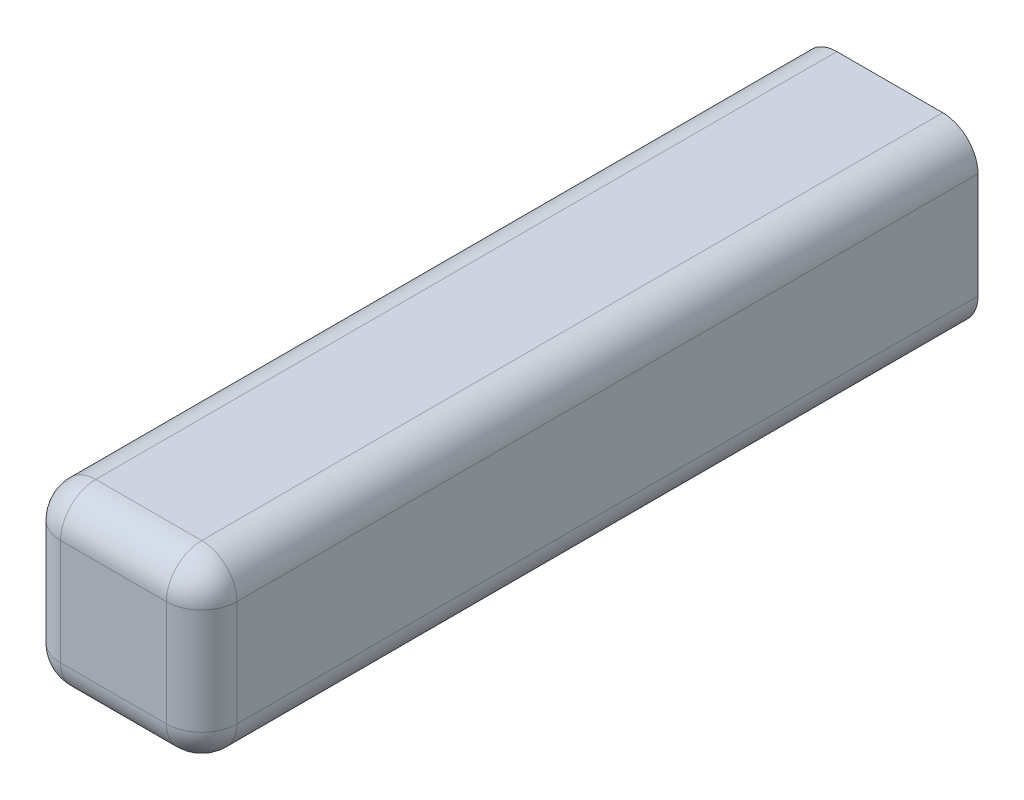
ISO-10303-21;
HEADER;
FILE_DESCRIPTION(('STEP AP214'),'2;1');
FILE_NAME('part.step','',(''),(''),'','','');
FILE_SCHEMA(('AUTOMOTIVE_DESIGN { 1 0 10303 214 1 1 1 1 }'));
ENDSEC;
DATA;
#1=APPLICATION_CONTEXT('core data for automotive mechanical design processes');
#2=APPLICATION_PROTOCOL_DEFINITION('international standard','automotive_design',2000,#1);
#3=PRODUCT_CONTEXT('',#1,'mechanical');
#4=PRODUCT('Part','Part','',(#3));
#5=PRODUCT_RELATED_PRODUCT_CATEGORY('part','',(#4));
#6=PRODUCT_DEFINITION_FORMATION('','',#4);
#7=PRODUCT_DEFINITION_CONTEXT('part definition',#1,'design');
#8=PRODUCT_DEFINITION('design','',#6,#7);
#9=PRODUCT_DEFINITION_SHAPE('','',#8);
#10=(LENGTH_UNIT() NAMED_UNIT(*) SI_UNIT(.MILLI.,.METRE.));
#11=(NAMED_UNIT(*) PLANE_ANGLE_UNIT() SI_UNIT($,.RADIAN.));
#12=(NAMED_UNIT(*) SI_UNIT($,.STERADIAN.) SOLID_ANGLE_UNIT());
#13=UNCERTAINTY_MEASURE_WITH_UNIT(LENGTH_MEASURE(1.E-05),#10,'distance_accuracy_value','');
#14=(GEOMETRIC_REPRESENTATION_CONTEXT(3) GLOBAL_UNCERTAINTY_ASSIGNED_CONTEXT((#13)) GLOBAL_UNIT_ASSIGNED_CONTEXT((#10,
#11,#12)) REPRESENTATION_CONTEXT('',''));
#15=CARTESIAN_POINT('',(0.,0.,0.));
#16=DIRECTION('',(0.,0.,1.));
#17=DIRECTION('',(1.,0.,0.));
#18=AXIS2_PLACEMENT_3D('',#15,#16,#17);
#19=CARTESIAN_POINT('',(0.,0.,22.));
#20=DIRECTION('',(1.,0.,0.));
#21=DIRECTION('',(0.,0.,-1.));
#22=AXIS2_PLACEMENT_3D('',#19,#20,#21);
#23=PLANE('',#22);
#24=DIRECTION('',(0.,-1.,0.));
#25=VECTOR('',#24,1.);
#26=CARTESIAN_POINT('',(0.,0.,21.));
#27=LINE('',#26,#25);
#28=CARTESIAN_POINT('',(0.,1.,21.));
#29=VERTEX_POINT('',#28);
#30=CARTESIAN_POINT('',(0.,4.,21.));
#31=VERTEX_POINT('',#30);
#32=EDGE_CURVE('E55',#29,#31,#27,.F.);
#33=ORIENTED_EDGE('',*,*,#32,.T.);
#34=DIRECTION('',(0.,0.,-1.));
#35=VECTOR('',#34,1.);
#36=CARTESIAN_POINT('',(0.,4.,22.));
#37=LINE('',#36,#35);
#38=CARTESIAN_POINT('',(0.,4.,0.));
#39=VERTEX_POINT('',#38);
#40=EDGE_CURVE('E11',#31,#39,#37,.T.);
#41=ORIENTED_EDGE('',*,*,#40,.T.);
#42=DIRECTION('',(0.,-1.,0.));
#43=VECTOR('',#42,1.);
#44=CARTESIAN_POINT('',(0.,0.,0.));
#45=LINE('',#44,#43);
#46=CARTESIAN_POINT('',(0.,1.,0.));
#47=VERTEX_POINT('',#46);
#48=EDGE_CURVE('E201',#39,#47,#45,.T.);
#49=ORIENTED_EDGE('',*,*,#48,.T.);
#50=DIRECTION('',(0.,0.,-1.));
#51=VECTOR('',#50,1.);
#52=CARTESIAN_POINT('',(0.,1.,22.));
#53=LINE('',#52,#51);
#54=EDGE_CURVE('E66',#47,#29,#53,.F.);
#55=ORIENTED_EDGE('',*,*,#54,.T.);
#56=EDGE_LOOP('',(#33,#41,#49,#55));
#57=FACE_BOUND('',#56,.T.);
#58=ADVANCED_FACE('F45',(#57),#23,.F.);
#59=CARTESIAN_POINT('',(0.,0.,22.));
#60=DIRECTION('',(0.,1.,0.));
#61=DIRECTION('',(0.,0.,1.));
#62=AXIS2_PLACEMENT_3D('',#59,#60,#61);
#63=PLANE('',#62);
#64=DIRECTION('',(1.,0.,0.));
#65=VECTOR('',#64,1.);
#66=CARTESIAN_POINT('',(0.,0.,0.));
#67=LINE('',#66,#65);
#68=CARTESIAN_POINT('',(1.,0.,0.));
#69=VERTEX_POINT('',#68);
#70=CARTESIAN_POINT('',(4.,0.,0.));
#71=VERTEX_POINT('',#70);
#72=EDGE_CURVE('E210',#69,#71,#67,.T.);
#73=ORIENTED_EDGE('',*,*,#72,.T.);
#74=DIRECTION('',(0.,0.,-1.));
#75=VECTOR('',#74,1.);
#76=CARTESIAN_POINT('',(4.,0.,22.));
#77=LINE('',#76,#75);
#78=CARTESIAN_POINT('',(4.,0.,21.));
#79=VERTEX_POINT('',#78);
#80=EDGE_CURVE('E278',#71,#79,#77,.F.);
#81=ORIENTED_EDGE('',*,*,#80,.T.);
#82=DIRECTION('',(1.,0.,0.));
#83=VECTOR('',#82,1.);
#84=CARTESIAN_POINT('',(0.,0.,21.));
#85=LINE('',#84,#83);
#86=CARTESIAN_POINT('',(1.,0.,21.));
#87=VERTEX_POINT('',#86);
#88=EDGE_CURVE('E274',#79,#87,#85,.F.);
#89=ORIENTED_EDGE('',*,*,#88,.T.);
#90=DIRECTION('',(0.,0.,-1.));
#91=VECTOR('',#90,1.);
#92=CARTESIAN_POINT('',(1.,0.,22.));
#93=LINE('',#92,#91);
#94=EDGE_CURVE('E271',#87,#69,#93,.T.);
#95=ORIENTED_EDGE('',*,*,#94,.T.);
#96=EDGE_LOOP('',(#73,#81,#89,#95));
#97=FACE_BOUND('',#96,.T.);
#98=ADVANCED_FACE('F408',(#97),#63,.F.);
#99=CARTESIAN_POINT('',(5.,0.,22.));
#100=DIRECTION('',(-1.,0.,0.));
#101=DIRECTION('',(0.,0.,1.));
#102=AXIS2_PLACEMENT_3D('',#99,#100,#101);
#103=PLANE('',#102);
#104=DIRECTION('',(0.,1.,0.));
#105=VECTOR('',#104,1.);
#106=CARTESIAN_POINT('',(5.,0.,21.));
#107=LINE('',#106,#105);
#108=CARTESIAN_POINT('',(5.,4.,21.));
#109=VERTEX_POINT('',#108);
#110=CARTESIAN_POINT('',(5.,1.,21.));
#111=VERTEX_POINT('',#110);
#112=EDGE_CURVE('E284',#109,#111,#107,.F.);
#113=ORIENTED_EDGE('',*,*,#112,.T.);
#114=DIRECTION('',(0.,0.,-1.));
#115=VECTOR('',#114,1.);
#116=CARTESIAN_POINT('',(5.,1.,22.));
#117=LINE('',#116,#115);
#118=CARTESIAN_POINT('',(5.,1.,0.));
#119=VERTEX_POINT('',#118);
#120=EDGE_CURVE('E287',#111,#119,#117,.T.);
#121=ORIENTED_EDGE('',*,*,#120,.T.);
#122=DIRECTION('',(0.,1.,0.));
#123=VECTOR('',#122,1.);
#124=CARTESIAN_POINT('',(5.,0.,0.));
#125=LINE('',#124,#123);
#126=CARTESIAN_POINT('',(5.,4.,0.));
#127=VERTEX_POINT('',#126);
#128=EDGE_CURVE('E214',#119,#127,#125,.T.);
#129=ORIENTED_EDGE('',*,*,#128,.T.);
#130=DIRECTION('',(0.,0.,-1.));
#131=VECTOR('',#130,1.);
#132=CARTESIAN_POINT('',(5.,4.,22.));
#133=LINE('',#132,#131);
#134=EDGE_CURVE('E281',#127,#109,#133,.F.);
#135=ORIENTED_EDGE('',*,*,#134,.T.);
#136=EDGE_LOOP('',(#113,#121,#129,#135));
#137=FACE_BOUND('',#136,.T.);
#138=ADVANCED_FACE('F391',(#137),#103,.F.);
#139=CARTESIAN_POINT('',(0.,5.,22.));
#140=DIRECTION('',(0.,-1.,0.));
#141=DIRECTION('',(0.,0.,-1.));
#142=AXIS2_PLACEMENT_3D('',#139,#140,#141);
#143=PLANE('',#142);
#144=DIRECTION('',(-1.,0.,0.));
#145=VECTOR('',#144,1.);
#146=CARTESIAN_POINT('',(0.,5.,21.));
#147=LINE('',#146,#145);
#148=CARTESIAN_POINT('',(1.,5.,21.));
#149=VERTEX_POINT('',#148);
#150=CARTESIAN_POINT('',(4.,5.,21.));
#151=VERTEX_POINT('',#150);
#152=EDGE_CURVE('E293',#149,#151,#147,.F.);
#153=ORIENTED_EDGE('',*,*,#152,.T.);
#154=DIRECTION('',(0.,0.,-1.));
#155=VECTOR('',#154,1.);
#156=CARTESIAN_POINT('',(4.,5.,22.));
#157=LINE('',#156,#155);
#158=CARTESIAN_POINT('',(4.,5.,0.));
#159=VERTEX_POINT('',#158);
#160=EDGE_CURVE('E296',#151,#159,#157,.T.);
#161=ORIENTED_EDGE('',*,*,#160,.T.);
#162=DIRECTION('',(-1.,0.,0.));
#163=VECTOR('',#162,1.);
#164=CARTESIAN_POINT('',(0.,5.,0.));
#165=LINE('',#164,#163);
#166=CARTESIAN_POINT('',(1.,5.,0.));
#167=VERTEX_POINT('',#166);
#168=EDGE_CURVE('E218',#159,#167,#165,.T.);
#169=ORIENTED_EDGE('',*,*,#168,.T.);
#170=DIRECTION('',(0.,0.,-1.));
#171=VECTOR('',#170,1.);
#172=CARTESIAN_POINT('',(1.,5.,22.));
#173=LINE('',#172,#171);
#174=EDGE_CURVE('E290',#167,#149,#173,.F.);
#175=ORIENTED_EDGE('',*,*,#174,.T.);
#176=EDGE_LOOP('',(#153,#161,#169,#175));
#177=FACE_BOUND('',#176,.T.);
#178=ADVANCED_FACE('F378',(#177),#143,.F.);
#179=CARTESIAN_POINT('',(0.,0.,22.));
#180=DIRECTION('',(0.,0.,-1.));
#181=DIRECTION('',(-1.,0.,0.));
#182=AXIS2_PLACEMENT_3D('',#179,#180,#181);
#183=PLANE('',#182);
#184=DIRECTION('',(0.,-1.,0.));
#185=VECTOR('',#184,1.);
#186=CARTESIAN_POINT('',(1.,0.,22.));
#187=LINE('',#186,#185);
#188=CARTESIAN_POINT('',(1.,4.,22.));
#189=VERTEX_POINT('',#188);
#190=CARTESIAN_POINT('',(1.,1.,22.));
#191=VERTEX_POINT('',#190);
#192=EDGE_CURVE('E258',#189,#191,#187,.T.);
#193=ORIENTED_EDGE('',*,*,#192,.T.);
#194=DIRECTION('',(1.,0.,0.));
#195=VECTOR('',#194,1.);
#196=CARTESIAN_POINT('',(0.,1.,22.));
#197=LINE('',#196,#195);
#198=CARTESIAN_POINT('',(4.,1.,22.));
#199=VERTEX_POINT('',#198);
#200=EDGE_CURVE('E267',#191,#199,#197,.T.);
#201=ORIENTED_EDGE('',*,*,#200,.T.);
#202=DIRECTION('',(0.,1.,0.));
#203=VECTOR('',#202,1.);
#204=CARTESIAN_POINT('',(4.,0.,22.));
#205=LINE('',#204,#203);
#206=CARTESIAN_POINT('',(4.,4.,22.));
#207=VERTEX_POINT('',#206);
#208=EDGE_CURVE('E264',#199,#207,#205,.T.);
#209=ORIENTED_EDGE('',*,*,#208,.T.);
#210=DIRECTION('',(-1.,0.,0.));
#211=VECTOR('',#210,1.);
#212=CARTESIAN_POINT('',(0.,4.,22.));
#213=LINE('',#212,#211);
#214=EDGE_CURVE('E261',#207,#189,#213,.T.);
#215=ORIENTED_EDGE('',*,*,#214,.T.);
#216=EDGE_LOOP('',(#193,#201,#209,#215));
#217=FACE_BOUND('',#216,.T.);
#218=ADVANCED_FACE('F368',(#217),#183,.F.);
#219=CARTESIAN_POINT('',(0.,0.,0.));
#220=DIRECTION('',(0.,0.,-1.));
#221=DIRECTION('',(-1.,0.,0.));
#222=AXIS2_PLACEMENT_3D('',#219,#220,#221);
#223=PLANE('',#222);
#224=DIRECTION('',(0.,1.,0.));
#225=VECTOR('',#224,1.);
#226=CARTESIAN_POINT('',(0.5,1.5,0.));
#227=LINE('',#226,#225);
#228=CARTESIAN_POINT('',(0.5,4.5,0.));
#229=VERTEX_POINT('',#228);
#230=CARTESIAN_POINT('',(0.5,0.500000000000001,0.));
#231=VERTEX_POINT('',#230);
#232=EDGE_CURVE('E243',#229,#231,#227,.F.);
#233=ORIENTED_EDGE('',*,*,#232,.T.);
#234=DIRECTION('',(-1.,0.,0.));
#235=VECTOR('',#234,1.);
#236=CARTESIAN_POINT('',(3.5,0.500000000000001,0.));
#237=LINE('',#236,#235);
#238=CARTESIAN_POINT('',(4.5,0.500000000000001,0.));
#239=VERTEX_POINT('',#238);
#240=EDGE_CURVE('E246',#231,#239,#237,.F.);
#241=ORIENTED_EDGE('',*,*,#240,.T.);
#242=DIRECTION('',(0.,-1.,0.));
#243=VECTOR('',#242,1.);
#244=CARTESIAN_POINT('',(4.5,3.5,0.));
#245=LINE('',#244,#243);
#246=CARTESIAN_POINT('',(4.5,4.5,0.));
#247=VERTEX_POINT('',#246);
#248=EDGE_CURVE('E237',#239,#247,#245,.F.);
#249=ORIENTED_EDGE('',*,*,#248,.T.);
#250=DIRECTION('',(1.,0.,0.));
#251=VECTOR('',#250,1.);
#252=CARTESIAN_POINT('',(1.5,4.5,0.));
#253=LINE('',#252,#251);
#254=EDGE_CURVE('E240',#247,#229,#253,.F.);
#255=ORIENTED_EDGE('',*,*,#254,.T.);
#256=EDGE_LOOP('',(#233,#241,#249,#255));
#257=FACE_BOUND('',#256,.T.);
#258=ORIENTED_EDGE('',*,*,#128,.F.);
#259=CARTESIAN_POINT('',(4.,1.,0.));
#260=DIRECTION('',(0.,0.,-1.));
#261=DIRECTION('',(-1.,0.,0.));
#262=AXIS2_PLACEMENT_3D('',#259,#260,#261);
#263=CIRCLE('',#262,1.);
#264=EDGE_CURVE('E234',#119,#71,#263,.T.);
#265=ORIENTED_EDGE('',*,*,#264,.T.);
#266=ORIENTED_EDGE('',*,*,#72,.F.);
#267=CARTESIAN_POINT('',(1.,1.,0.));
#268=DIRECTION('',(0.,0.,-1.));
#269=DIRECTION('',(-1.,0.,0.));
#270=AXIS2_PLACEMENT_3D('',#267,#268,#269);
#271=CIRCLE('',#270,1.);
#272=EDGE_CURVE('E225',#69,#47,#271,.T.);
#273=ORIENTED_EDGE('',*,*,#272,.T.);
#274=ORIENTED_EDGE('',*,*,#48,.F.);
#275=CARTESIAN_POINT('',(1.,4.,0.));
#276=DIRECTION('',(0.,0.,-1.));
#277=DIRECTION('',(-1.,0.,0.));
#278=AXIS2_PLACEMENT_3D('',#275,#276,#277);
#279=CIRCLE('',#278,1.);
#280=EDGE_CURVE('E228',#39,#167,#279,.T.);
#281=ORIENTED_EDGE('',*,*,#280,.T.);
#282=ORIENTED_EDGE('',*,*,#168,.F.);
#283=CARTESIAN_POINT('',(4.,4.,0.));
#284=DIRECTION('',(0.,0.,-1.));
#285=DIRECTION('',(-1.,0.,0.));
#286=AXIS2_PLACEMENT_3D('',#283,#284,#285);
#287=CIRCLE('',#286,1.);
#288=EDGE_CURVE('E231',#159,#127,#287,.T.);
#289=ORIENTED_EDGE('',*,*,#288,.T.);
#290=EDGE_LOOP('',(#258,#265,#266,#273,#274,#281,#282,#289));
#291=FACE_BOUND('',#290,.T.);
#292=ADVANCED_FACE('F388',(#257,#291),#223,.T.);
#293=CARTESIAN_POINT('',(3.5,3.5,19.));
#294=DIRECTION('',(1.,0.,0.));
#295=DIRECTION('',(0.,0.,-1.));
#296=AXIS2_PLACEMENT_3D('',#293,#294,#295);
#297=PLANE('',#296);
#298=DIRECTION('',(0.,0.,-1.));
#299=VECTOR('',#298,1.);
#300=CARTESIAN_POINT('',(3.5,3.5,19.));
#301=LINE('',#300,#299);
#302=CARTESIAN_POINT('',(3.5,3.5,19.));
#303=VERTEX_POINT('',#302);
#304=CARTESIAN_POINT('',(3.5,3.5,1.));
#305=VERTEX_POINT('',#304);
#306=EDGE_CURVE('E198',#303,#305,#301,.T.);
#307=ORIENTED_EDGE('',*,*,#306,.T.);
#308=DIRECTION('',(0.,-1.,0.));
#309=VECTOR('',#308,1.);
#310=CARTESIAN_POINT('',(3.5,1.5,1.));
#311=LINE('',#310,#309);
#312=CARTESIAN_POINT('',(3.5,1.5,1.));
#313=VERTEX_POINT('',#312);
#314=EDGE_CURVE('E166',#305,#313,#311,.T.);
#315=ORIENTED_EDGE('',*,*,#314,.T.);
#316=DIRECTION('',(0.,0.,-1.));
#317=VECTOR('',#316,1.);
#318=CARTESIAN_POINT('',(3.5,1.5,19.));
#319=LINE('',#318,#317);
#320=CARTESIAN_POINT('',(3.5,1.5,19.));
#321=VERTEX_POINT('',#320);
#322=EDGE_CURVE('E158',#321,#313,#319,.T.);
#323=ORIENTED_EDGE('',*,*,#322,.F.);
#324=DIRECTION('',(0.,-1.,0.));
#325=VECTOR('',#324,1.);
#326=CARTESIAN_POINT('',(3.5,3.5,19.));
#327=LINE('',#326,#325);
#328=EDGE_CURVE('E163',#303,#321,#327,.T.);
#329=ORIENTED_EDGE('',*,*,#328,.F.);
#330=EDGE_LOOP('',(#307,#315,#323,#329));
#331=FACE_BOUND('',#330,.T.);
#332=ADVANCED_FACE('F161',(#331),#297,.F.);
#333=CARTESIAN_POINT('',(3.5,3.5,19.));
#334=DIRECTION('',(0.,1.,0.));
#335=DIRECTION('',(0.,0.,1.));
#336=AXIS2_PLACEMENT_3D('',#333,#334,#335);
#337=PLANE('',#336);
#338=DIRECTION('',(0.,0.,-1.));
#339=VECTOR('',#338,1.);
#340=CARTESIAN_POINT('',(1.5,3.5,19.));
#341=LINE('',#340,#339);
#342=CARTESIAN_POINT('',(1.5,3.5,19.));
#343=VERTEX_POINT('',#342);
#344=CARTESIAN_POINT('',(1.5,3.5,1.));
#345=VERTEX_POINT('',#344);
#346=EDGE_CURVE('E202',#343,#345,#341,.T.);
#347=ORIENTED_EDGE('',*,*,#346,.T.);
#348=DIRECTION('',(1.,0.,0.));
#349=VECTOR('',#348,1.);
#350=CARTESIAN_POINT('',(3.5,3.5,1.));
#351=LINE('',#350,#349);
#352=EDGE_CURVE('E253',#345,#305,#351,.T.);
#353=ORIENTED_EDGE('',*,*,#352,.T.);
#354=ORIENTED_EDGE('',*,*,#306,.F.);
#355=DIRECTION('',(1.,0.,0.));
#356=VECTOR('',#355,1.);
#357=CARTESIAN_POINT('',(3.5,3.5,19.));
#358=LINE('',#357,#356);
#359=EDGE_CURVE('E172',#343,#303,#358,.T.);
#360=ORIENTED_EDGE('',*,*,#359,.F.);
#361=EDGE_LOOP('',(#347,#353,#354,#360));
#362=FACE_BOUND('',#361,.T.);
#363=ADVANCED_FACE('F582',(#362),#337,.F.);
#364=CARTESIAN_POINT('',(1.5,3.5,19.));
#365=DIRECTION('',(-1.,0.,0.));
#366=DIRECTION('',(0.,-1.,0.));
#367=AXIS2_PLACEMENT_3D('',#364,#365,#366);
#368=PLANE('',#367);
#369=DIRECTION('',(0.,0.,-1.));
#370=VECTOR('',#369,1.);
#371=CARTESIAN_POINT('',(1.5,1.5,19.));
#372=LINE('',#371,#370);
#373=CARTESIAN_POINT('',(1.5,1.5,19.));
#374=VERTEX_POINT('',#373);
#375=CARTESIAN_POINT('',(1.5,1.5,1.));
#376=VERTEX_POINT('',#375);
#377=EDGE_CURVE('E171',#374,#376,#372,.T.);
#378=ORIENTED_EDGE('',*,*,#377,.T.);
#379=DIRECTION('',(0.,1.,0.));
#380=VECTOR('',#379,1.);
#381=CARTESIAN_POINT('',(1.5,3.5,1.));
#382=LINE('',#381,#380);
#383=EDGE_CURVE('E250',#376,#345,#382,.T.);
#384=ORIENTED_EDGE('',*,*,#383,.T.);
#385=ORIENTED_EDGE('',*,*,#346,.F.);
#386=DIRECTION('',(0.,1.,0.));
#387=VECTOR('',#386,1.);
#388=CARTESIAN_POINT('',(1.5,3.5,19.));
#389=LINE('',#388,#387);
#390=EDGE_CURVE('E182',#374,#343,#389,.T.);
#391=ORIENTED_EDGE('',*,*,#390,.F.);
#392=EDGE_LOOP('',(#378,#384,#385,#391));
#393=FACE_BOUND('',#392,.T.);
#394=ADVANCED_FACE('F573',(#393),#368,.F.);
#395=CARTESIAN_POINT('',(3.5,1.5,19.));
#396=DIRECTION('',(0.,-1.,0.));
#397=DIRECTION('',(0.,0.,-1.));
#398=AXIS2_PLACEMENT_3D('',#395,#396,#397);
#399=PLANE('',#398);
#400=ORIENTED_EDGE('',*,*,#322,.T.);
#401=DIRECTION('',(-1.,0.,0.));
#402=VECTOR('',#401,1.);
#403=CARTESIAN_POINT('',(1.5,1.5,1.));
#404=LINE('',#403,#402);
#405=EDGE_CURVE('E222',#313,#376,#404,.T.);
#406=ORIENTED_EDGE('',*,*,#405,.T.);
#407=ORIENTED_EDGE('',*,*,#377,.F.);
#408=DIRECTION('',(-1.,0.,0.));
#409=VECTOR('',#408,1.);
#410=CARTESIAN_POINT('',(3.5,1.5,19.));
#411=LINE('',#410,#409);
#412=EDGE_CURVE('E175',#321,#374,#411,.T.);
#413=ORIENTED_EDGE('',*,*,#412,.F.);
#414=EDGE_LOOP('',(#400,#406,#407,#413));
#415=FACE_BOUND('',#414,.T.);
#416=ADVANCED_FACE('F176',(#415),#399,.F.);
#417=CARTESIAN_POINT('',(0.,0.,19.));
#418=DIRECTION('',(0.,0.,-1.));
#419=DIRECTION('',(-1.,0.,0.));
#420=AXIS2_PLACEMENT_3D('',#417,#418,#419);
#421=PLANE('',#420);
#422=ORIENTED_EDGE('',*,*,#328,.T.);
#423=ORIENTED_EDGE('',*,*,#412,.T.);
#424=ORIENTED_EDGE('',*,*,#390,.T.);
#425=ORIENTED_EDGE('',*,*,#359,.T.);
#426=EDGE_LOOP('',(#422,#423,#424,#425));
#427=FACE_BOUND('',#426,.T.);
#428=ADVANCED_FACE('F184',(#427),#421,.T.);
#429=CARTESIAN_POINT('',(3.5,4.5,1.));
#430=DIRECTION('',(-1.,0.,0.));
#431=DIRECTION('',(0.,0.,1.));
#432=AXIS2_PLACEMENT_3D('',#429,#430,#431);
#433=CYLINDRICAL_SURFACE('',#432,1.);
#434=CARTESIAN_POINT('',(0.5,4.5,1.));
#435=DIRECTION('',(-0.707106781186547,-0.707106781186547,0.));
#436=DIRECTION('',(0.707106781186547,-0.707106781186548,0.));
#437=AXIS2_PLACEMENT_3D('',#434,#435,#436);
#438=ELLIPSE('',#437,1.41421356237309,1.);
#439=EDGE_CURVE('E191',#229,#345,#438,.T.);
#440=ORIENTED_EDGE('',*,*,#439,.F.);
#441=ORIENTED_EDGE('',*,*,#254,.F.);
#442=CARTESIAN_POINT('',(4.5,4.5,1.));
#443=DIRECTION('',(-0.707106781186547,0.707106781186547,0.));
#444=DIRECTION('',(-0.707106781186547,-0.707106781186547,0.));
#445=AXIS2_PLACEMENT_3D('',#442,#443,#444);
#446=ELLIPSE('',#445,1.41421356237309,1.);
#447=EDGE_CURVE('E187',#305,#247,#446,.F.);
#448=ORIENTED_EDGE('',*,*,#447,.F.);
#449=ORIENTED_EDGE('',*,*,#352,.F.);
#450=EDGE_LOOP('',(#440,#441,#448,#449));
#451=FACE_BOUND('',#450,.T.);
#452=ADVANCED_FACE('F445',(#451),#433,.T.);
#453=CARTESIAN_POINT('',(4.5,3.5,1.));
#454=DIRECTION('',(0.,1.,0.));
#455=DIRECTION('',(0.,0.,1.));
#456=AXIS2_PLACEMENT_3D('',#453,#454,#455);
#457=CYLINDRICAL_SURFACE('',#456,1.);
#458=ORIENTED_EDGE('',*,*,#447,.T.);
#459=ORIENTED_EDGE('',*,*,#248,.F.);
#460=CARTESIAN_POINT('',(4.5,0.500000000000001,1.));
#461=DIRECTION('',(0.707106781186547,0.707106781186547,0.));
#462=DIRECTION('',(0.707106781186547,-0.707106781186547,0.));
#463=AXIS2_PLACEMENT_3D('',#460,#461,#462);
#464=ELLIPSE('',#463,1.41421356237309,1.);
#465=EDGE_CURVE('E306',#313,#239,#464,.F.);
#466=ORIENTED_EDGE('',*,*,#465,.F.);
#467=ORIENTED_EDGE('',*,*,#314,.F.);
#468=EDGE_LOOP('',(#458,#459,#466,#467));
#469=FACE_BOUND('',#468,.T.);
#470=ADVANCED_FACE('F441',(#469),#457,.T.);
#471=CARTESIAN_POINT('',(0.5,3.5,1.));
#472=DIRECTION('',(0.,-1.,0.));
#473=DIRECTION('',(1.,0.,0.));
#474=AXIS2_PLACEMENT_3D('',#471,#472,#473);
#475=CYLINDRICAL_SURFACE('',#474,1.);
#476=ORIENTED_EDGE('',*,*,#439,.T.);
#477=ORIENTED_EDGE('',*,*,#383,.F.);
#478=CARTESIAN_POINT('',(0.5,0.500000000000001,1.));
#479=DIRECTION('',(0.707106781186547,-0.707106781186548,0.));
#480=DIRECTION('',(0.707106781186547,0.707106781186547,0.));
#481=AXIS2_PLACEMENT_3D('',#478,#479,#480);
#482=ELLIPSE('',#481,1.4142135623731,1.);
#483=EDGE_CURVE('E303',#231,#376,#482,.T.);
#484=ORIENTED_EDGE('',*,*,#483,.F.);
#485=ORIENTED_EDGE('',*,*,#232,.F.);
#486=EDGE_LOOP('',(#476,#477,#484,#485));
#487=FACE_BOUND('',#486,.T.);
#488=ADVANCED_FACE('F437',(#487),#475,.T.);
#489=CARTESIAN_POINT('',(3.5,0.500000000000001,1.));
#490=DIRECTION('',(1.,0.,0.));
#491=DIRECTION('',(0.,0.,-1.));
#492=AXIS2_PLACEMENT_3D('',#489,#490,#491);
#493=CYLINDRICAL_SURFACE('',#492,1.);
#494=ORIENTED_EDGE('',*,*,#465,.T.);
#495=ORIENTED_EDGE('',*,*,#240,.F.);
#496=ORIENTED_EDGE('',*,*,#483,.T.);
#497=ORIENTED_EDGE('',*,*,#405,.F.);
#498=EDGE_LOOP('',(#494,#495,#496,#497));
#499=FACE_BOUND('',#498,.T.);
#500=ADVANCED_FACE('F434',(#499),#493,.T.);
#501=CARTESIAN_POINT('',(1.,4.,22.));
#502=DIRECTION('',(0.,0.,-1.));
#503=DIRECTION('',(-1.,0.,0.));
#504=AXIS2_PLACEMENT_3D('',#501,#502,#503);
#505=CYLINDRICAL_SURFACE('',#504,1.);
#506=ORIENTED_EDGE('',*,*,#280,.F.);
#507=ORIENTED_EDGE('',*,*,#40,.F.);
#508=CARTESIAN_POINT('',(1.,4.,21.));
#509=DIRECTION('',(0.,0.,1.));
#510=DIRECTION('',(1.,0.,0.));
#511=AXIS2_PLACEMENT_3D('',#508,#509,#510);
#512=CIRCLE('',#511,1.);
#513=EDGE_CURVE('E49',#149,#31,#512,.T.);
#514=ORIENTED_EDGE('',*,*,#513,.F.);
#515=ORIENTED_EDGE('',*,*,#174,.F.);
#516=EDGE_LOOP('',(#506,#507,#514,#515));
#517=FACE_BOUND('',#516,.T.);
#518=ADVANCED_FACE('F47',(#517),#505,.T.);
#519=CARTESIAN_POINT('',(0.,4.,21.));
#520=DIRECTION('',(-1.,0.,0.));
#521=DIRECTION('',(0.,0.,1.));
#522=AXIS2_PLACEMENT_3D('',#519,#520,#521);
#523=CYLINDRICAL_SURFACE('',#522,1.);
#524=CARTESIAN_POINT('',(4.,4.,21.));
#525=DIRECTION('',(1.,0.,0.));
#526=DIRECTION('',(0.,0.,-1.));
#527=AXIS2_PLACEMENT_3D('',#524,#525,#526);
#528=CIRCLE('',#527,1.);
#529=EDGE_CURVE('E346',#151,#207,#528,.T.);
#530=ORIENTED_EDGE('',*,*,#529,.F.);
#531=ORIENTED_EDGE('',*,*,#152,.F.);
#532=CARTESIAN_POINT('',(1.,4.,21.));
#533=DIRECTION('',(-1.,0.,0.));
#534=DIRECTION('',(0.,0.,1.));
#535=AXIS2_PLACEMENT_3D('',#532,#533,#534);
#536=CIRCLE('',#535,1.);
#537=EDGE_CURVE('E349',#189,#149,#536,.T.);
#538=ORIENTED_EDGE('',*,*,#537,.F.);
#539=ORIENTED_EDGE('',*,*,#214,.F.);
#540=EDGE_LOOP('',(#530,#531,#538,#539));
#541=FACE_BOUND('',#540,.T.);
#542=ADVANCED_FACE('F375',(#541),#523,.T.);
#543=CARTESIAN_POINT('',(4.,4.,22.));
#544=DIRECTION('',(0.,0.,-1.));
#545=DIRECTION('',(-1.,0.,0.));
#546=AXIS2_PLACEMENT_3D('',#543,#544,#545);
#547=CYLINDRICAL_SURFACE('',#546,1.);
#548=ORIENTED_EDGE('',*,*,#288,.F.);
#549=ORIENTED_EDGE('',*,*,#160,.F.);
#550=CARTESIAN_POINT('',(4.,4.,21.));
#551=DIRECTION('',(0.,0.,1.));
#552=DIRECTION('',(1.,0.,0.));
#553=AXIS2_PLACEMENT_3D('',#550,#551,#552);
#554=CIRCLE('',#553,1.);
#555=EDGE_CURVE('E342',#109,#151,#554,.T.);
#556=ORIENTED_EDGE('',*,*,#555,.F.);
#557=ORIENTED_EDGE('',*,*,#134,.F.);
#558=EDGE_LOOP('',(#548,#549,#556,#557));
#559=FACE_BOUND('',#558,.T.);
#560=ADVANCED_FACE('F383',(#559),#547,.T.);
#561=CARTESIAN_POINT('',(1.,4.,21.));
#562=DIRECTION('',(0.,1.,0.));
#563=DIRECTION('',(0.,0.,1.));
#564=AXIS2_PLACEMENT_3D('',#561,#562,#563);
#565=SPHERICAL_SURFACE('',#564,1.);
#566=ORIENTED_EDGE('',*,*,#537,.T.);
#567=ORIENTED_EDGE('',*,*,#513,.T.);
#568=CARTESIAN_POINT('',(1.,4.,21.));
#569=DIRECTION('',(0.,1.,0.));
#570=DIRECTION('',(0.,0.,1.));
#571=AXIS2_PLACEMENT_3D('',#568,#569,#570);
#572=CIRCLE('',#571,1.);
#573=EDGE_CURVE('E338',#189,#31,#572,.F.);
#574=ORIENTED_EDGE('',*,*,#573,.F.);
#575=EDGE_LOOP('',(#566,#567,#574));
#576=FACE_BOUND('',#575,.T.);
#577=ADVANCED_FACE('F358',(#576),#565,.T.);
#578=CARTESIAN_POINT('',(4.,4.,21.));
#579=DIRECTION('',(0.,1.,0.));
#580=DIRECTION('',(0.,0.,1.));
#581=AXIS2_PLACEMENT_3D('',#578,#579,#580);
#582=SPHERICAL_SURFACE('',#581,1.);
#583=ORIENTED_EDGE('',*,*,#555,.T.);
#584=ORIENTED_EDGE('',*,*,#529,.T.);
#585=CARTESIAN_POINT('',(4.,4.,21.));
#586=DIRECTION('',(0.,1.,0.));
#587=DIRECTION('',(0.,0.,1.));
#588=AXIS2_PLACEMENT_3D('',#585,#586,#587);
#589=CIRCLE('',#588,1.);
#590=EDGE_CURVE('E334',#109,#207,#589,.F.);
#591=ORIENTED_EDGE('',*,*,#590,.F.);
#592=EDGE_LOOP('',(#583,#584,#591));
#593=FACE_BOUND('',#592,.T.);
#594=ADVANCED_FACE('F494',(#593),#582,.T.);
#595=CARTESIAN_POINT('',(1.,1.,22.));
#596=DIRECTION('',(0.,0.,-1.));
#597=DIRECTION('',(-1.,0.,0.));
#598=AXIS2_PLACEMENT_3D('',#595,#596,#597);
#599=CYLINDRICAL_SURFACE('',#598,1.);
#600=ORIENTED_EDGE('',*,*,#272,.F.);
#601=ORIENTED_EDGE('',*,*,#94,.F.);
#602=CARTESIAN_POINT('',(1.,1.,21.));
#603=DIRECTION('',(0.,0.,1.));
#604=DIRECTION('',(1.,0.,0.));
#605=AXIS2_PLACEMENT_3D('',#602,#603,#604);
#606=CIRCLE('',#605,1.);
#607=EDGE_CURVE('E330',#29,#87,#606,.T.);
#608=ORIENTED_EDGE('',*,*,#607,.F.);
#609=ORIENTED_EDGE('',*,*,#54,.F.);
#610=EDGE_LOOP('',(#600,#601,#608,#609));
#611=FACE_BOUND('',#610,.T.);
#612=ADVANCED_FACE('F414',(#611),#599,.T.);
#613=CARTESIAN_POINT('',(1.,0.,21.));
#614=DIRECTION('',(0.,-1.,0.));
#615=DIRECTION('',(0.,0.,-1.));
#616=AXIS2_PLACEMENT_3D('',#613,#614,#615);
#617=CYLINDRICAL_SURFACE('',#616,1.);
#618=ORIENTED_EDGE('',*,*,#573,.T.);
#619=ORIENTED_EDGE('',*,*,#32,.F.);
#620=CARTESIAN_POINT('',(1.,1.,21.));
#621=DIRECTION('',(0.,-1.,0.));
#622=DIRECTION('',(0.,0.,-1.));
#623=AXIS2_PLACEMENT_3D('',#620,#621,#622);
#624=CIRCLE('',#623,1.);
#625=EDGE_CURVE('E326',#191,#29,#624,.T.);
#626=ORIENTED_EDGE('',*,*,#625,.F.);
#627=ORIENTED_EDGE('',*,*,#192,.F.);
#628=EDGE_LOOP('',(#618,#619,#626,#627));
#629=FACE_BOUND('',#628,.T.);
#630=ADVANCED_FACE('F363',(#629),#617,.T.);
#631=CARTESIAN_POINT('',(4.,0.,21.));
#632=DIRECTION('',(0.,1.,0.));
#633=DIRECTION('',(0.,0.,1.));
#634=AXIS2_PLACEMENT_3D('',#631,#632,#633);
#635=CYLINDRICAL_SURFACE('',#634,1.);
#636=ORIENTED_EDGE('',*,*,#590,.T.);
#637=ORIENTED_EDGE('',*,*,#208,.F.);
#638=CARTESIAN_POINT('',(4.,1.,21.));
#639=DIRECTION('',(0.,-1.,0.));
#640=DIRECTION('',(0.,0.,-1.));
#641=AXIS2_PLACEMENT_3D('',#638,#639,#640);
#642=CIRCLE('',#641,1.);
#643=EDGE_CURVE('E322',#111,#199,#642,.T.);
#644=ORIENTED_EDGE('',*,*,#643,.F.);
#645=ORIENTED_EDGE('',*,*,#112,.F.);
#646=EDGE_LOOP('',(#636,#637,#644,#645));
#647=FACE_BOUND('',#646,.T.);
#648=ADVANCED_FACE('F401',(#647),#635,.T.);
#649=CARTESIAN_POINT('',(4.,1.,22.));
#650=DIRECTION('',(0.,0.,-1.));
#651=DIRECTION('',(-1.,0.,0.));
#652=AXIS2_PLACEMENT_3D('',#649,#650,#651);
#653=CYLINDRICAL_SURFACE('',#652,1.);
#654=ORIENTED_EDGE('',*,*,#264,.F.);
#655=ORIENTED_EDGE('',*,*,#120,.F.);
#656=CARTESIAN_POINT('',(4.,1.,21.));
#657=DIRECTION('',(0.,0.,1.));
#658=DIRECTION('',(1.,0.,0.));
#659=AXIS2_PLACEMENT_3D('',#656,#657,#658);
#660=CIRCLE('',#659,1.);
#661=EDGE_CURVE('E318',#79,#111,#660,.T.);
#662=ORIENTED_EDGE('',*,*,#661,.F.);
#663=ORIENTED_EDGE('',*,*,#80,.F.);
#664=EDGE_LOOP('',(#654,#655,#662,#663));
#665=FACE_BOUND('',#664,.T.);
#666=ADVANCED_FACE('F397',(#665),#653,.T.);
#667=CARTESIAN_POINT('',(1.,1.,21.));
#668=DIRECTION('',(-1.,0.,0.));
#669=DIRECTION('',(0.,0.,1.));
#670=AXIS2_PLACEMENT_3D('',#667,#668,#669);
#671=SPHERICAL_SURFACE('',#670,1.);
#672=ORIENTED_EDGE('',*,*,#625,.T.);
#673=ORIENTED_EDGE('',*,*,#607,.T.);
#674=CARTESIAN_POINT('',(1.,1.,21.));
#675=DIRECTION('',(-1.,0.,0.));
#676=DIRECTION('',(0.,0.,1.));
#677=AXIS2_PLACEMENT_3D('',#674,#675,#676);
#678=CIRCLE('',#677,1.);
#679=EDGE_CURVE('E315',#191,#87,#678,.F.);
#680=ORIENTED_EDGE('',*,*,#679,.F.);
#681=EDGE_LOOP('',(#672,#673,#680));
#682=FACE_BOUND('',#681,.T.);
#683=ADVANCED_FACE('F416',(#682),#671,.T.);
#684=CARTESIAN_POINT('',(4.,1.,21.));
#685=DIRECTION('',(1.,0.,0.));
#686=DIRECTION('',(0.,0.,-1.));
#687=AXIS2_PLACEMENT_3D('',#684,#685,#686);
#688=SPHERICAL_SURFACE('',#687,1.);
#689=ORIENTED_EDGE('',*,*,#661,.T.);
#690=ORIENTED_EDGE('',*,*,#643,.T.);
#691=CARTESIAN_POINT('',(4.,1.,21.));
#692=DIRECTION('',(1.,0.,0.));
#693=DIRECTION('',(0.,0.,-1.));
#694=AXIS2_PLACEMENT_3D('',#691,#692,#693);
#695=CIRCLE('',#694,1.);
#696=EDGE_CURVE('E312',#79,#199,#695,.F.);
#697=ORIENTED_EDGE('',*,*,#696,.F.);
#698=EDGE_LOOP('',(#689,#690,#697));
#699=FACE_BOUND('',#698,.T.);
#700=ADVANCED_FACE('F404',(#699),#688,.T.);
#701=CARTESIAN_POINT('',(0.,1.,21.));
#702=DIRECTION('',(1.,0.,0.));
#703=DIRECTION('',(0.,0.,-1.));
#704=AXIS2_PLACEMENT_3D('',#701,#702,#703);
#705=CYLINDRICAL_SURFACE('',#704,1.);
#706=ORIENTED_EDGE('',*,*,#679,.T.);
#707=ORIENTED_EDGE('',*,*,#88,.F.);
#708=ORIENTED_EDGE('',*,*,#696,.T.);
#709=ORIENTED_EDGE('',*,*,#200,.F.);
#710=EDGE_LOOP('',(#706,#707,#708,#709));
#711=FACE_BOUND('',#710,.T.);
#712=ADVANCED_FACE('F406',(#711),#705,.T.);
#713=CLOSED_SHELL('',(#58,#98,#138,#178,#218,#292,#332,#363,#394,#416,#428,#452,#470,#488,#500,
#518,#542,#560,#577,#594,#612,#630,#648,#666,#683,#700,#712));
#714=MANIFOLD_SOLID_BREP('B2',#713);
#715=ADVANCED_BREP_SHAPE_REPRESENTATION('',(#18,#714),#14);
#716=SHAPE_DEFINITION_REPRESENTATION(#9,#715);
ENDSEC;
END-ISO-10303-21;
